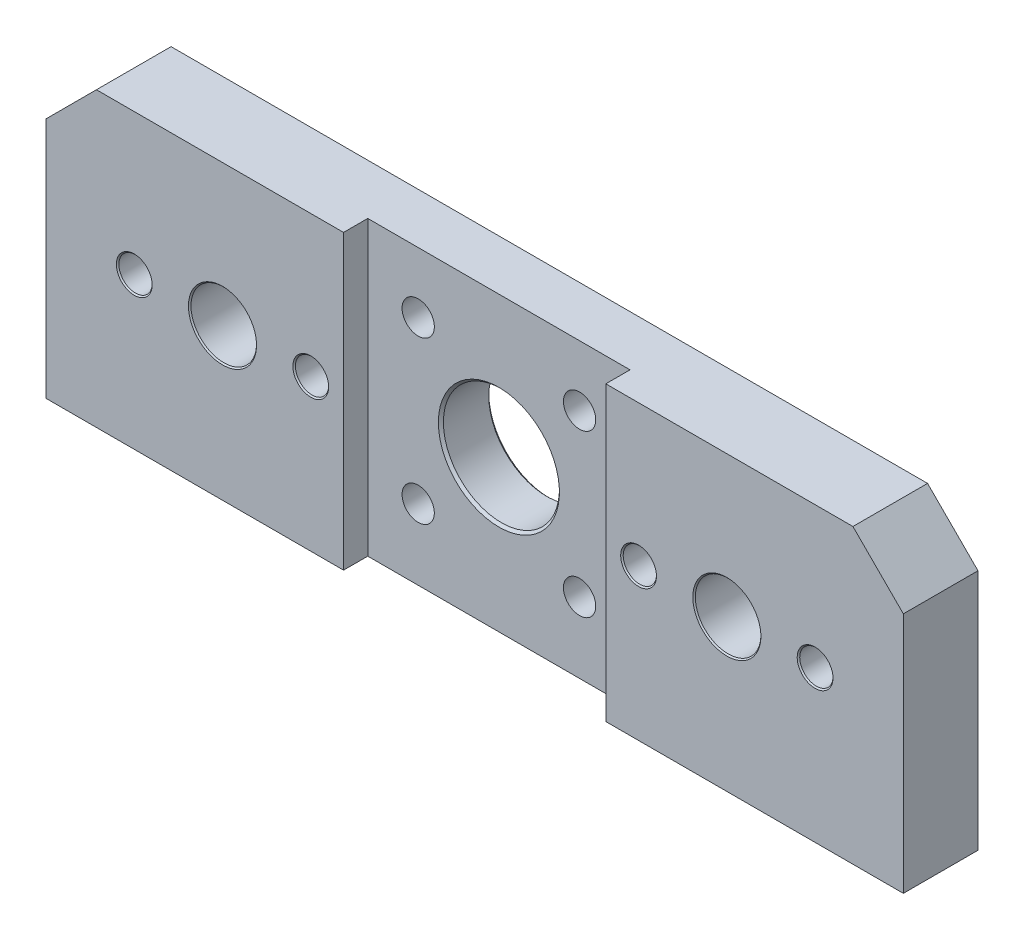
ISO-10303-21;
HEADER;
FILE_DESCRIPTION(('STEP AP214'),'2;1');
FILE_NAME('part.step','',(''),(''),'','','');
FILE_SCHEMA(('AUTOMOTIVE_DESIGN { 1 0 10303 214 1 1 1 1 }'));
ENDSEC;
DATA;
#1=APPLICATION_CONTEXT('core data for automotive mechanical design processes');
#2=APPLICATION_PROTOCOL_DEFINITION('international standard','automotive_design',2000,#1);
#3=PRODUCT_CONTEXT('',#1,'mechanical');
#4=PRODUCT('Part','Part','',(#3));
#5=PRODUCT_RELATED_PRODUCT_CATEGORY('part','',(#4));
#6=PRODUCT_DEFINITION_FORMATION('','',#4);
#7=PRODUCT_DEFINITION_CONTEXT('part definition',#1,'design');
#8=PRODUCT_DEFINITION('design','',#6,#7);
#9=PRODUCT_DEFINITION_SHAPE('','',#8);
#10=(LENGTH_UNIT() NAMED_UNIT(*) SI_UNIT(.MILLI.,.METRE.));
#11=(NAMED_UNIT(*) PLANE_ANGLE_UNIT() SI_UNIT($,.RADIAN.));
#12=(NAMED_UNIT(*) SI_UNIT($,.STERADIAN.) SOLID_ANGLE_UNIT());
#13=UNCERTAINTY_MEASURE_WITH_UNIT(LENGTH_MEASURE(1.E-05),#10,'distance_accuracy_value','');
#14=(GEOMETRIC_REPRESENTATION_CONTEXT(3) GLOBAL_UNCERTAINTY_ASSIGNED_CONTEXT((#13)) GLOBAL_UNIT_ASSIGNED_CONTEXT((#10,
#11,#12)) REPRESENTATION_CONTEXT('',''));
#15=CARTESIAN_POINT('',(0.,0.,0.));
#16=DIRECTION('',(0.,0.,1.));
#17=DIRECTION('',(1.,0.,0.));
#18=AXIS2_PLACEMENT_3D('',#15,#16,#17);
#19=CARTESIAN_POINT('',(-85.,58.,14.8));
#20=DIRECTION('',(0.,0.,-1.));
#21=DIRECTION('',(-1.,0.,0.));
#22=AXIS2_PLACEMENT_3D('',#19,#20,#21);
#23=PLANE('',#22);
#24=CARTESIAN_POINT('',(-67.5,30.,14.8));
#25=DIRECTION('',(0.,0.,-1.));
#26=DIRECTION('',(-1.,0.,0.));
#27=AXIS2_PLACEMENT_3D('',#24,#25,#26);
#28=CIRCLE('',#27,3.55);
#29=CARTESIAN_POINT('',(-71.05,30.,14.8));
#30=VERTEX_POINT('',#29);
#31=EDGE_CURVE('E297',#30,#30,#28,.T.);
#32=ORIENTED_EDGE('',*,*,#31,.T.);
#33=EDGE_LOOP('',(#32));
#34=FACE_BOUND('',#33,.T.);
#35=CARTESIAN_POINT('',(-50.,30.,14.8));
#36=DIRECTION('',(0.,0.,-1.));
#37=DIRECTION('',(-1.,0.,0.));
#38=AXIS2_PLACEMENT_3D('',#35,#36,#37);
#39=CIRCLE('',#38,6.75);
#40=CARTESIAN_POINT('',(-56.75,30.,14.8));
#41=VERTEX_POINT('',#40);
#42=EDGE_CURVE('E294',#41,#41,#39,.T.);
#43=ORIENTED_EDGE('',*,*,#42,.T.);
#44=EDGE_LOOP('',(#43));
#45=FACE_BOUND('',#44,.T.);
#46=CARTESIAN_POINT('',(-32.5,30.,14.8));
#47=DIRECTION('',(0.,0.,-1.));
#48=DIRECTION('',(-1.,0.,0.));
#49=AXIS2_PLACEMENT_3D('',#46,#47,#48);
#50=CIRCLE('',#49,3.55);
#51=CARTESIAN_POINT('',(-36.05,30.,14.8));
#52=VERTEX_POINT('',#51);
#53=EDGE_CURVE('E291',#52,#52,#50,.T.);
#54=ORIENTED_EDGE('',*,*,#53,.T.);
#55=EDGE_LOOP('',(#54));
#56=FACE_BOUND('',#55,.T.);
#57=DIRECTION('',(1.,0.,0.));
#58=VECTOR('',#57,1.);
#59=CARTESIAN_POINT('',(-85.,0.,14.8));
#60=LINE('',#59,#58);
#61=CARTESIAN_POINT('',(-85.,0.,14.8));
#62=VERTEX_POINT('',#61);
#63=CARTESIAN_POINT('',(-26.,0.,14.8));
#64=VERTEX_POINT('',#63);
#65=EDGE_CURVE('E198',#62,#64,#60,.T.);
#66=ORIENTED_EDGE('',*,*,#65,.T.);
#67=DIRECTION('',(0.,1.,0.));
#68=VECTOR('',#67,1.);
#69=CARTESIAN_POINT('',(-26.,58.,14.8));
#70=LINE('',#69,#68);
#71=CARTESIAN_POINT('',(-26.,58.,14.8));
#72=VERTEX_POINT('',#71);
#73=EDGE_CURVE('E231',#64,#72,#70,.T.);
#74=ORIENTED_EDGE('',*,*,#73,.T.);
#75=DIRECTION('',(-1.,0.,0.));
#76=VECTOR('',#75,1.);
#77=CARTESIAN_POINT('',(-85.,58.,14.8));
#78=LINE('',#77,#76);
#79=CARTESIAN_POINT('',(-75.,58.,14.8));
#80=VERTEX_POINT('',#79);
#81=EDGE_CURVE('E203',#72,#80,#78,.T.);
#82=ORIENTED_EDGE('',*,*,#81,.T.);
#83=DIRECTION('',(0.707106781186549,0.707106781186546,0.));
#84=VECTOR('',#83,1.);
#85=CARTESIAN_POINT('',(-85.,48.,14.8));
#86=LINE('',#85,#84);
#87=CARTESIAN_POINT('',(-85.,48.,14.8));
#88=VERTEX_POINT('',#87);
#89=EDGE_CURVE('E228',#80,#88,#86,.F.);
#90=ORIENTED_EDGE('',*,*,#89,.T.);
#91=DIRECTION('',(0.,-1.,0.));
#92=VECTOR('',#91,1.);
#93=CARTESIAN_POINT('',(-85.,0.,14.8));
#94=LINE('',#93,#92);
#95=EDGE_CURVE('E195',#88,#62,#94,.T.);
#96=ORIENTED_EDGE('',*,*,#95,.T.);
#97=EDGE_LOOP('',(#66,#74,#82,#90,#96));
#98=FACE_BOUND('',#97,.T.);
#99=ADVANCED_FACE('F33',(#34,#45,#56,#98),#23,.F.);
#100=CARTESIAN_POINT('',(-85.,0.,14.8));
#101=DIRECTION('',(1.,0.,0.));
#102=DIRECTION('',(0.,0.,-1.));
#103=AXIS2_PLACEMENT_3D('',#100,#101,#102);
#104=PLANE('',#103);
#105=ORIENTED_EDGE('',*,*,#95,.F.);
#106=DIRECTION('',(0.,0.,-1.));
#107=VECTOR('',#106,1.);
#108=CARTESIAN_POINT('',(-85.,48.,14.8));
#109=LINE('',#108,#107);
#110=CARTESIAN_POINT('',(-85.,48.,0.));
#111=VERTEX_POINT('',#110);
#112=EDGE_CURVE('E213',#88,#111,#109,.T.);
#113=ORIENTED_EDGE('',*,*,#112,.T.);
#114=DIRECTION('',(0.,-1.,0.));
#115=VECTOR('',#114,1.);
#116=CARTESIAN_POINT('',(-85.,0.,0.));
#117=LINE('',#116,#115);
#118=CARTESIAN_POINT('',(-85.,0.,0.));
#119=VERTEX_POINT('',#118);
#120=EDGE_CURVE('E186',#111,#119,#117,.T.);
#121=ORIENTED_EDGE('',*,*,#120,.T.);
#122=DIRECTION('',(0.,0.,-1.));
#123=VECTOR('',#122,1.);
#124=CARTESIAN_POINT('',(-85.,0.,14.8));
#125=LINE('',#124,#123);
#126=EDGE_CURVE('E210',#62,#119,#125,.T.);
#127=ORIENTED_EDGE('',*,*,#126,.F.);
#128=EDGE_LOOP('',(#105,#113,#121,#127));
#129=FACE_BOUND('',#128,.T.);
#130=ADVANCED_FACE('F35',(#129),#104,.F.);
#131=CARTESIAN_POINT('',(-85.,0.,14.8));
#132=DIRECTION('',(0.,1.,0.));
#133=DIRECTION('',(0.,0.,1.));
#134=AXIS2_PLACEMENT_3D('',#131,#132,#133);
#135=PLANE('',#134);
#136=CARTESIAN_POINT('',(73.,0.,7.5));
#137=DIRECTION('',(0.,-1.,0.));
#138=DIRECTION('',(0.,0.,-1.));
#139=AXIS2_PLACEMENT_3D('',#136,#137,#138);
#140=CIRCLE('',#139,2.4);
#141=CARTESIAN_POINT('',(73.,0.,5.1));
#142=VERTEX_POINT('',#141);
#143=EDGE_CURVE('E126',#142,#142,#140,.T.);
#144=ORIENTED_EDGE('',*,*,#143,.F.);
#145=EDGE_LOOP('',(#144));
#146=FACE_BOUND('',#145,.T.);
#147=CARTESIAN_POINT('',(-73.,0.,7.49999999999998));
#148=DIRECTION('',(0.,-1.,0.));
#149=DIRECTION('',(0.,0.,-1.));
#150=AXIS2_PLACEMENT_3D('',#147,#148,#149);
#151=CIRCLE('',#150,2.4);
#152=CARTESIAN_POINT('',(-73.,0.,5.09999999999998));
#153=VERTEX_POINT('',#152);
#154=EDGE_CURVE('E139',#153,#153,#151,.T.);
#155=ORIENTED_EDGE('',*,*,#154,.F.);
#156=EDGE_LOOP('',(#155));
#157=FACE_BOUND('',#156,.T.);
#158=DIRECTION('',(1.,0.,0.));
#159=VECTOR('',#158,1.);
#160=CARTESIAN_POINT('',(-26.,0.,10.));
#161=LINE('',#160,#159);
#162=CARTESIAN_POINT('',(-26.,0.,10.));
#163=VERTEX_POINT('',#162);
#164=CARTESIAN_POINT('',(26.,0.,10.));
#165=VERTEX_POINT('',#164);
#166=EDGE_CURVE('E170',#163,#165,#161,.T.);
#167=ORIENTED_EDGE('',*,*,#166,.F.);
#168=DIRECTION('',(0.,0.,1.));
#169=VECTOR('',#168,1.);
#170=CARTESIAN_POINT('',(-26.,0.,10.));
#171=LINE('',#170,#169);
#172=EDGE_CURVE('E176',#163,#64,#171,.T.);
#173=ORIENTED_EDGE('',*,*,#172,.T.);
#174=ORIENTED_EDGE('',*,*,#65,.F.);
#175=ORIENTED_EDGE('',*,*,#126,.T.);
#176=DIRECTION('',(1.,0.,0.));
#177=VECTOR('',#176,1.);
#178=CARTESIAN_POINT('',(-85.,0.,0.));
#179=LINE('',#178,#177);
#180=CARTESIAN_POINT('',(85.,0.,0.));
#181=VERTEX_POINT('',#180);
#182=EDGE_CURVE('E188',#119,#181,#179,.T.);
#183=ORIENTED_EDGE('',*,*,#182,.T.);
#184=DIRECTION('',(0.,0.,-1.));
#185=VECTOR('',#184,1.);
#186=CARTESIAN_POINT('',(85.,0.,14.8));
#187=LINE('',#186,#185);
#188=CARTESIAN_POINT('',(85.,0.,14.8));
#189=VERTEX_POINT('',#188);
#190=EDGE_CURVE('E207',#189,#181,#187,.T.);
#191=ORIENTED_EDGE('',*,*,#190,.F.);
#192=CARTESIAN_POINT('',(26.,0.,14.8));
#193=VERTEX_POINT('',#192);
#194=EDGE_CURVE('E197',#193,#189,#60,.T.);
#195=ORIENTED_EDGE('',*,*,#194,.F.);
#196=DIRECTION('',(0.,0.,1.));
#197=VECTOR('',#196,1.);
#198=CARTESIAN_POINT('',(26.,0.,10.));
#199=LINE('',#198,#197);
#200=EDGE_CURVE('E48',#165,#193,#199,.T.);
#201=ORIENTED_EDGE('',*,*,#200,.F.);
#202=EDGE_LOOP('',(#167,#173,#174,#175,#183,#191,#195,#201));
#203=FACE_BOUND('',#202,.T.);
#204=ADVANCED_FACE('F355',(#146,#157,#203),#135,.F.);
#205=CARTESIAN_POINT('',(85.,0.,14.8));
#206=DIRECTION('',(-1.,0.,0.));
#207=DIRECTION('',(0.,-1.,0.));
#208=AXIS2_PLACEMENT_3D('',#205,#206,#207);
#209=PLANE('',#208);
#210=DIRECTION('',(0.,1.,0.));
#211=VECTOR('',#210,1.);
#212=CARTESIAN_POINT('',(85.,0.,0.));
#213=LINE('',#212,#211);
#214=CARTESIAN_POINT('',(85.,47.9999999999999,0.));
#215=VERTEX_POINT('',#214);
#216=EDGE_CURVE('E190',#181,#215,#213,.T.);
#217=ORIENTED_EDGE('',*,*,#216,.T.);
#218=DIRECTION('',(0.,0.,1.));
#219=VECTOR('',#218,1.);
#220=CARTESIAN_POINT('',(85.,48.,14.8));
#221=LINE('',#220,#219);
#222=CARTESIAN_POINT('',(85.,48.,14.8));
#223=VERTEX_POINT('',#222);
#224=EDGE_CURVE('E56',#215,#223,#221,.T.);
#225=ORIENTED_EDGE('',*,*,#224,.T.);
#226=DIRECTION('',(0.,1.,0.));
#227=VECTOR('',#226,1.);
#228=CARTESIAN_POINT('',(85.,0.,14.8));
#229=LINE('',#228,#227);
#230=EDGE_CURVE('E201',#189,#223,#229,.T.);
#231=ORIENTED_EDGE('',*,*,#230,.F.);
#232=ORIENTED_EDGE('',*,*,#190,.T.);
#233=EDGE_LOOP('',(#217,#225,#231,#232));
#234=FACE_BOUND('',#233,.T.);
#235=ADVANCED_FACE('F351',(#234),#209,.F.);
#236=CARTESIAN_POINT('',(-85.,58.,14.8));
#237=DIRECTION('',(0.,-1.,0.));
#238=DIRECTION('',(0.,0.,-1.));
#239=AXIS2_PLACEMENT_3D('',#236,#237,#238);
#240=PLANE('',#239);
#241=ORIENTED_EDGE('',*,*,#81,.F.);
#242=DIRECTION('',(0.,0.,-1.));
#243=VECTOR('',#242,1.);
#244=CARTESIAN_POINT('',(-26.,58.,14.8));
#245=LINE('',#244,#243);
#246=CARTESIAN_POINT('',(-26.,58.,10.));
#247=VERTEX_POINT('',#246);
#248=EDGE_CURVE('E183',#72,#247,#245,.T.);
#249=ORIENTED_EDGE('',*,*,#248,.T.);
#250=DIRECTION('',(1.,0.,0.));
#251=VECTOR('',#250,1.);
#252=CARTESIAN_POINT('',(-85.,58.,10.));
#253=LINE('',#252,#251);
#254=CARTESIAN_POINT('',(26.,58.,10.));
#255=VERTEX_POINT('',#254);
#256=EDGE_CURVE('E234',#247,#255,#253,.T.);
#257=ORIENTED_EDGE('',*,*,#256,.T.);
#258=DIRECTION('',(0.,0.,1.));
#259=VECTOR('',#258,1.);
#260=CARTESIAN_POINT('',(26.,58.,14.8));
#261=LINE('',#260,#259);
#262=CARTESIAN_POINT('',(26.,58.,14.8));
#263=VERTEX_POINT('',#262);
#264=EDGE_CURVE('E178',#255,#263,#261,.T.);
#265=ORIENTED_EDGE('',*,*,#264,.T.);
#266=CARTESIAN_POINT('',(75.0000000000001,58.,14.8));
#267=VERTEX_POINT('',#266);
#268=EDGE_CURVE('E204',#267,#263,#78,.T.);
#269=ORIENTED_EDGE('',*,*,#268,.F.);
#270=DIRECTION('',(0.,0.,-1.));
#271=VECTOR('',#270,1.);
#272=CARTESIAN_POINT('',(75.0000000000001,58.,14.8));
#273=LINE('',#272,#271);
#274=CARTESIAN_POINT('',(75.0000000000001,58.,0.));
#275=VERTEX_POINT('',#274);
#276=EDGE_CURVE('E220',#267,#275,#273,.T.);
#277=ORIENTED_EDGE('',*,*,#276,.T.);
#278=DIRECTION('',(-1.,0.,0.));
#279=VECTOR('',#278,1.);
#280=CARTESIAN_POINT('',(-85.,58.,0.));
#281=LINE('',#280,#279);
#282=CARTESIAN_POINT('',(-75.,58.,0.));
#283=VERTEX_POINT('',#282);
#284=EDGE_CURVE('E192',#275,#283,#281,.T.);
#285=ORIENTED_EDGE('',*,*,#284,.T.);
#286=DIRECTION('',(0.,0.,1.));
#287=VECTOR('',#286,1.);
#288=CARTESIAN_POINT('',(-75.,58.,14.8));
#289=LINE('',#288,#287);
#290=EDGE_CURVE('E223',#283,#80,#289,.T.);
#291=ORIENTED_EDGE('',*,*,#290,.T.);
#292=EDGE_LOOP('',(#241,#249,#257,#265,#269,#277,#285,#291));
#293=FACE_BOUND('',#292,.T.);
#294=ADVANCED_FACE('F332',(#293),#240,.F.);
#295=CARTESIAN_POINT('',(32.5,30.,14.8));
#296=DIRECTION('',(0.,0.,-1.));
#297=DIRECTION('',(-1.,0.,0.));
#298=AXIS2_PLACEMENT_3D('',#295,#296,#297);
#299=CIRCLE('',#298,3.55);
#300=CARTESIAN_POINT('',(28.95,30.,14.8));
#301=VERTEX_POINT('',#300);
#302=EDGE_CURVE('E312',#301,#301,#299,.T.);
#303=ORIENTED_EDGE('',*,*,#302,.T.);
#304=EDGE_LOOP('',(#303));
#305=FACE_BOUND('',#304,.T.);
#306=CARTESIAN_POINT('',(50.,30.,14.8));
#307=DIRECTION('',(0.,0.,-1.));
#308=DIRECTION('',(-1.,0.,0.));
#309=AXIS2_PLACEMENT_3D('',#306,#307,#308);
#310=CIRCLE('',#309,6.75);
#311=CARTESIAN_POINT('',(43.25,30.,14.8));
#312=VERTEX_POINT('',#311);
#313=EDGE_CURVE('E309',#312,#312,#310,.T.);
#314=ORIENTED_EDGE('',*,*,#313,.T.);
#315=EDGE_LOOP('',(#314));
#316=FACE_BOUND('',#315,.T.);
#317=CARTESIAN_POINT('',(67.5,30.,14.8));
#318=DIRECTION('',(0.,0.,-1.));
#319=DIRECTION('',(-1.,0.,0.));
#320=AXIS2_PLACEMENT_3D('',#317,#318,#319);
#321=CIRCLE('',#320,3.55);
#322=CARTESIAN_POINT('',(63.95,30.,14.8));
#323=VERTEX_POINT('',#322);
#324=EDGE_CURVE('E306',#323,#323,#321,.T.);
#325=ORIENTED_EDGE('',*,*,#324,.T.);
#326=EDGE_LOOP('',(#325));
#327=FACE_BOUND('',#326,.T.);
#328=ORIENTED_EDGE('',*,*,#268,.T.);
#329=DIRECTION('',(0.,1.,0.));
#330=VECTOR('',#329,1.);
#331=CARTESIAN_POINT('',(26.,0.,14.8));
#332=LINE('',#331,#330);
#333=EDGE_CURVE('E166',#193,#263,#332,.T.);
#334=ORIENTED_EDGE('',*,*,#333,.F.);
#335=ORIENTED_EDGE('',*,*,#194,.T.);
#336=ORIENTED_EDGE('',*,*,#230,.T.);
#337=DIRECTION('',(0.707106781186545,-0.70710678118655,0.));
#338=VECTOR('',#337,1.);
#339=CARTESIAN_POINT('',(75.0000000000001,58.,14.8));
#340=LINE('',#339,#338);
#341=EDGE_CURVE('E226',#223,#267,#340,.F.);
#342=ORIENTED_EDGE('',*,*,#341,.T.);
#343=EDGE_LOOP('',(#328,#334,#335,#336,#342));
#344=FACE_BOUND('',#343,.T.);
#345=ADVANCED_FACE('F328',(#305,#316,#327,#344),#23,.F.);
#346=CARTESIAN_POINT('',(-85.,58.,0.));
#347=DIRECTION('',(0.,0.,-1.));
#348=DIRECTION('',(-1.,0.,0.));
#349=AXIS2_PLACEMENT_3D('',#346,#347,#348);
#350=PLANE('',#349);
#351=CARTESIAN_POINT('',(16.,46.,0.));
#352=DIRECTION('',(0.,0.,1.));
#353=DIRECTION('',(1.,0.,0.));
#354=AXIS2_PLACEMENT_3D('',#351,#352,#353);
#355=CIRCLE('',#354,3.2);
#356=CARTESIAN_POINT('',(19.2,46.,0.));
#357=VERTEX_POINT('',#356);
#358=EDGE_CURVE('E619',#357,#357,#355,.T.);
#359=ORIENTED_EDGE('',*,*,#358,.T.);
#360=EDGE_LOOP('',(#359));
#361=FACE_BOUND('',#360,.T.);
#362=CARTESIAN_POINT('',(16.,14.,0.));
#363=DIRECTION('',(0.,0.,1.));
#364=DIRECTION('',(1.,0.,0.));
#365=AXIS2_PLACEMENT_3D('',#362,#363,#364);
#366=CIRCLE('',#365,3.2);
#367=CARTESIAN_POINT('',(19.2,14.,0.));
#368=VERTEX_POINT('',#367);
#369=EDGE_CURVE('E620',#368,#368,#366,.T.);
#370=ORIENTED_EDGE('',*,*,#369,.T.);
#371=EDGE_LOOP('',(#370));
#372=FACE_BOUND('',#371,.T.);
#373=CARTESIAN_POINT('',(-16.,46.,0.));
#374=DIRECTION('',(0.,0.,1.));
#375=DIRECTION('',(1.,0.,0.));
#376=AXIS2_PLACEMENT_3D('',#373,#374,#375);
#377=CIRCLE('',#376,3.2);
#378=CARTESIAN_POINT('',(-12.8,46.,0.));
#379=VERTEX_POINT('',#378);
#380=EDGE_CURVE('E627',#379,#379,#377,.T.);
#381=ORIENTED_EDGE('',*,*,#380,.T.);
#382=EDGE_LOOP('',(#381));
#383=FACE_BOUND('',#382,.T.);
#384=CARTESIAN_POINT('',(-16.,14.,0.));
#385=DIRECTION('',(0.,0.,1.));
#386=DIRECTION('',(1.,0.,0.));
#387=AXIS2_PLACEMENT_3D('',#384,#385,#386);
#388=CIRCLE('',#387,3.2);
#389=CARTESIAN_POINT('',(-12.8,14.,0.));
#390=VERTEX_POINT('',#389);
#391=EDGE_CURVE('E133',#390,#390,#388,.T.);
#392=ORIENTED_EDGE('',*,*,#391,.T.);
#393=EDGE_LOOP('',(#392));
#394=FACE_BOUND('',#393,.T.);
#395=CARTESIAN_POINT('',(67.5,30.,0.));
#396=DIRECTION('',(0.,0.,-1.));
#397=DIRECTION('',(-1.,0.,0.));
#398=AXIS2_PLACEMENT_3D('',#395,#396,#397);
#399=CIRCLE('',#398,6.25000000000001);
#400=CARTESIAN_POINT('',(61.25,30.,0.));
#401=VERTEX_POINT('',#400);
#402=EDGE_CURVE('E267',#401,#401,#399,.F.);
#403=ORIENTED_EDGE('',*,*,#402,.T.);
#404=EDGE_LOOP('',(#403));
#405=FACE_BOUND('',#404,.T.);
#406=CARTESIAN_POINT('',(50.,30.,0.));
#407=DIRECTION('',(0.,0.,-1.));
#408=DIRECTION('',(-1.,0.,0.));
#409=AXIS2_PLACEMENT_3D('',#406,#407,#408);
#410=CIRCLE('',#409,6.75);
#411=CARTESIAN_POINT('',(43.25,30.,0.));
#412=VERTEX_POINT('',#411);
#413=EDGE_CURVE('E264',#412,#412,#410,.F.);
#414=ORIENTED_EDGE('',*,*,#413,.T.);
#415=EDGE_LOOP('',(#414));
#416=FACE_BOUND('',#415,.T.);
#417=CARTESIAN_POINT('',(32.5,30.,0.));
#418=DIRECTION('',(0.,0.,-1.));
#419=DIRECTION('',(-1.,0.,0.));
#420=AXIS2_PLACEMENT_3D('',#417,#418,#419);
#421=CIRCLE('',#420,6.25);
#422=CARTESIAN_POINT('',(26.25,30.,0.));
#423=VERTEX_POINT('',#422);
#424=EDGE_CURVE('E261',#423,#423,#421,.F.);
#425=ORIENTED_EDGE('',*,*,#424,.T.);
#426=EDGE_LOOP('',(#425));
#427=FACE_BOUND('',#426,.T.);
#428=CARTESIAN_POINT('',(-32.5,30.,0.));
#429=DIRECTION('',(0.,0.,-1.));
#430=DIRECTION('',(-1.,0.,0.));
#431=AXIS2_PLACEMENT_3D('',#428,#429,#430);
#432=CIRCLE('',#431,6.25);
#433=CARTESIAN_POINT('',(-38.75,30.,0.));
#434=VERTEX_POINT('',#433);
#435=EDGE_CURVE('E258',#434,#434,#432,.F.);
#436=ORIENTED_EDGE('',*,*,#435,.T.);
#437=EDGE_LOOP('',(#436));
#438=FACE_BOUND('',#437,.T.);
#439=CARTESIAN_POINT('',(-50.,30.,0.));
#440=DIRECTION('',(0.,0.,-1.));
#441=DIRECTION('',(-1.,0.,0.));
#442=AXIS2_PLACEMENT_3D('',#439,#440,#441);
#443=CIRCLE('',#442,6.75);
#444=CARTESIAN_POINT('',(-56.75,30.,0.));
#445=VERTEX_POINT('',#444);
#446=EDGE_CURVE('E255',#445,#445,#443,.F.);
#447=ORIENTED_EDGE('',*,*,#446,.T.);
#448=EDGE_LOOP('',(#447));
#449=FACE_BOUND('',#448,.T.);
#450=CARTESIAN_POINT('',(-67.5,30.,0.));
#451=DIRECTION('',(0.,0.,-1.));
#452=DIRECTION('',(-1.,0.,0.));
#453=AXIS2_PLACEMENT_3D('',#450,#451,#452);
#454=CIRCLE('',#453,6.25000000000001);
#455=CARTESIAN_POINT('',(-73.75,30.,0.));
#456=VERTEX_POINT('',#455);
#457=EDGE_CURVE('E252',#456,#456,#454,.F.);
#458=ORIENTED_EDGE('',*,*,#457,.T.);
#459=EDGE_LOOP('',(#458));
#460=FACE_BOUND('',#459,.T.);
#461=CARTESIAN_POINT('',(0.,30.,0.));
#462=DIRECTION('',(0.,0.,-1.));
#463=DIRECTION('',(-1.,0.,0.));
#464=AXIS2_PLACEMENT_3D('',#461,#462,#463);
#465=CIRCLE('',#464,12.);
#466=CARTESIAN_POINT('',(-12.,30.,0.));
#467=VERTEX_POINT('',#466);
#468=EDGE_CURVE('E237',#467,#467,#465,.F.);
#469=ORIENTED_EDGE('',*,*,#468,.T.);
#470=EDGE_LOOP('',(#469));
#471=FACE_BOUND('',#470,.T.);
#472=ORIENTED_EDGE('',*,*,#120,.F.);
#473=DIRECTION('',(-0.707106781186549,-0.707106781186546,0.));
#474=VECTOR('',#473,1.);
#475=CARTESIAN_POINT('',(-80.,53.,0.));
#476=LINE('',#475,#474);
#477=EDGE_CURVE('E218',#111,#283,#476,.F.);
#478=ORIENTED_EDGE('',*,*,#477,.T.);
#479=ORIENTED_EDGE('',*,*,#284,.F.);
#480=DIRECTION('',(-0.707106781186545,0.70710678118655,0.));
#481=VECTOR('',#480,1.);
#482=CARTESIAN_POINT('',(-4.99999999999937,138.,0.));
#483=LINE('',#482,#481);
#484=EDGE_CURVE('E216',#275,#215,#483,.F.);
#485=ORIENTED_EDGE('',*,*,#484,.T.);
#486=ORIENTED_EDGE('',*,*,#216,.F.);
#487=ORIENTED_EDGE('',*,*,#182,.F.);
#488=EDGE_LOOP('',(#472,#478,#479,#485,#486,#487));
#489=FACE_BOUND('',#488,.T.);
#490=ADVANCED_FACE('F331',(#361,#372,#383,#394,#405,#416,#427,#438,#449,#460,#471,#489),#350,.T.);
#491=CARTESIAN_POINT('',(-85.,48.,14.8));
#492=DIRECTION('',(0.707106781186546,-0.707106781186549,0.));
#493=DIRECTION('',(0.707106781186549,0.707106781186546,0.));
#494=AXIS2_PLACEMENT_3D('',#491,#492,#493);
#495=PLANE('',#494);
#496=ORIENTED_EDGE('',*,*,#89,.F.);
#497=ORIENTED_EDGE('',*,*,#290,.F.);
#498=ORIENTED_EDGE('',*,*,#477,.F.);
#499=ORIENTED_EDGE('',*,*,#112,.F.);
#500=EDGE_LOOP('',(#496,#497,#498,#499));
#501=FACE_BOUND('',#500,.T.);
#502=ADVANCED_FACE('F363',(#501),#495,.F.);
#503=CARTESIAN_POINT('',(75.0000000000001,58.,14.8));
#504=DIRECTION('',(-0.70710678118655,-0.707106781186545,0.));
#505=DIRECTION('',(0.707106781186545,-0.70710678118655,0.));
#506=AXIS2_PLACEMENT_3D('',#503,#504,#505);
#507=PLANE('',#506);
#508=ORIENTED_EDGE('',*,*,#341,.F.);
#509=ORIENTED_EDGE('',*,*,#224,.F.);
#510=ORIENTED_EDGE('',*,*,#484,.F.);
#511=ORIENTED_EDGE('',*,*,#276,.F.);
#512=EDGE_LOOP('',(#508,#509,#510,#511));
#513=FACE_BOUND('',#512,.T.);
#514=ADVANCED_FACE('F346',(#513),#507,.F.);
#515=CARTESIAN_POINT('',(-26.,0.,10.));
#516=DIRECTION('',(0.,0.,-1.));
#517=DIRECTION('',(-1.,0.,0.));
#518=AXIS2_PLACEMENT_3D('',#515,#516,#517);
#519=PLANE('',#518);
#520=CARTESIAN_POINT('',(16.,46.,10.));
#521=DIRECTION('',(0.,0.,1.));
#522=DIRECTION('',(1.,0.,0.));
#523=AXIS2_PLACEMENT_3D('',#520,#521,#522);
#524=CIRCLE('',#523,3.2);
#525=CARTESIAN_POINT('',(19.2,46.,10.));
#526=VERTEX_POINT('',#525);
#527=EDGE_CURVE('E529',#526,#526,#524,.T.);
#528=ORIENTED_EDGE('',*,*,#527,.F.);
#529=EDGE_LOOP('',(#528));
#530=FACE_BOUND('',#529,.T.);
#531=CARTESIAN_POINT('',(16.,14.,10.));
#532=DIRECTION('',(0.,0.,1.));
#533=DIRECTION('',(1.,0.,0.));
#534=AXIS2_PLACEMENT_3D('',#531,#532,#533);
#535=CIRCLE('',#534,3.2);
#536=CARTESIAN_POINT('',(19.2,14.,10.));
#537=VERTEX_POINT('',#536);
#538=EDGE_CURVE('E533',#537,#537,#535,.T.);
#539=ORIENTED_EDGE('',*,*,#538,.F.);
#540=EDGE_LOOP('',(#539));
#541=FACE_BOUND('',#540,.T.);
#542=CARTESIAN_POINT('',(-16.,46.,10.));
#543=DIRECTION('',(0.,0.,1.));
#544=DIRECTION('',(1.,0.,0.));
#545=AXIS2_PLACEMENT_3D('',#542,#543,#544);
#546=CIRCLE('',#545,3.2);
#547=CARTESIAN_POINT('',(-12.8,46.,10.));
#548=VERTEX_POINT('',#547);
#549=EDGE_CURVE('E537',#548,#548,#546,.T.);
#550=ORIENTED_EDGE('',*,*,#549,.F.);
#551=EDGE_LOOP('',(#550));
#552=FACE_BOUND('',#551,.T.);
#553=CARTESIAN_POINT('',(-16.,14.,10.));
#554=DIRECTION('',(0.,0.,1.));
#555=DIRECTION('',(1.,0.,0.));
#556=AXIS2_PLACEMENT_3D('',#553,#554,#555);
#557=CIRCLE('',#556,3.2);
#558=CARTESIAN_POINT('',(-12.8,14.,10.));
#559=VERTEX_POINT('',#558);
#560=EDGE_CURVE('E127',#559,#559,#557,.T.);
#561=ORIENTED_EDGE('',*,*,#560,.F.);
#562=EDGE_LOOP('',(#561));
#563=FACE_BOUND('',#562,.T.);
#564=CARTESIAN_POINT('',(0.,30.,10.));
#565=DIRECTION('',(0.,0.,-1.));
#566=DIRECTION('',(-1.,0.,0.));
#567=AXIS2_PLACEMENT_3D('',#564,#565,#566);
#568=CIRCLE('',#567,12.);
#569=CARTESIAN_POINT('',(-12.,30.,10.));
#570=VERTEX_POINT('',#569);
#571=EDGE_CURVE('E246',#570,#570,#568,.T.);
#572=ORIENTED_EDGE('',*,*,#571,.T.);
#573=EDGE_LOOP('',(#572));
#574=FACE_BOUND('',#573,.T.);
#575=DIRECTION('',(0.,-1.,0.));
#576=VECTOR('',#575,1.);
#577=CARTESIAN_POINT('',(-26.,0.,10.));
#578=LINE('',#577,#576);
#579=EDGE_CURVE('E168',#247,#163,#578,.T.);
#580=ORIENTED_EDGE('',*,*,#579,.T.);
#581=ORIENTED_EDGE('',*,*,#166,.T.);
#582=DIRECTION('',(0.,1.,0.));
#583=VECTOR('',#582,1.);
#584=CARTESIAN_POINT('',(26.,0.,10.));
#585=LINE('',#584,#583);
#586=EDGE_CURVE('E173',#165,#255,#585,.T.);
#587=ORIENTED_EDGE('',*,*,#586,.T.);
#588=ORIENTED_EDGE('',*,*,#256,.F.);
#589=EDGE_LOOP('',(#580,#581,#587,#588));
#590=FACE_BOUND('',#589,.T.);
#591=ADVANCED_FACE('F371',(#530,#541,#552,#563,#574,#590),#519,.F.);
#592=CARTESIAN_POINT('',(-26.,0.,10.));
#593=DIRECTION('',(-1.,0.,0.));
#594=DIRECTION('',(0.,-1.,0.));
#595=AXIS2_PLACEMENT_3D('',#592,#593,#594);
#596=PLANE('',#595);
#597=ORIENTED_EDGE('',*,*,#73,.F.);
#598=ORIENTED_EDGE('',*,*,#172,.F.);
#599=ORIENTED_EDGE('',*,*,#579,.F.);
#600=ORIENTED_EDGE('',*,*,#248,.F.);
#601=EDGE_LOOP('',(#597,#598,#599,#600));
#602=FACE_BOUND('',#601,.T.);
#603=ADVANCED_FACE('F368',(#602),#596,.F.);
#604=CARTESIAN_POINT('',(26.,0.,10.));
#605=DIRECTION('',(1.,0.,0.));
#606=DIRECTION('',(0.,1.,0.));
#607=AXIS2_PLACEMENT_3D('',#604,#605,#606);
#608=PLANE('',#607);
#609=ORIENTED_EDGE('',*,*,#586,.F.);
#610=ORIENTED_EDGE('',*,*,#200,.T.);
#611=ORIENTED_EDGE('',*,*,#333,.T.);
#612=ORIENTED_EDGE('',*,*,#264,.F.);
#613=EDGE_LOOP('',(#609,#610,#611,#612));
#614=FACE_BOUND('',#613,.T.);
#615=ADVANCED_FACE('F372',(#614),#608,.F.);
#616=CARTESIAN_POINT('',(0.,30.,0.));
#617=DIRECTION('',(0.,0.,1.));
#618=DIRECTION('',(1.,0.,0.));
#619=AXIS2_PLACEMENT_3D('',#616,#617,#618);
#620=CYLINDRICAL_SURFACE('',#619,11.5);
#621=CARTESIAN_POINT('',(0.,30.,0.500000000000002));
#622=DIRECTION('',(0.,0.,-1.));
#623=DIRECTION('',(-1.,0.,0.));
#624=AXIS2_PLACEMENT_3D('',#621,#622,#623);
#625=CIRCLE('',#624,11.5);
#626=CARTESIAN_POINT('',(-11.5,30.,0.500000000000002));
#627=VERTEX_POINT('',#626);
#628=EDGE_CURVE('E243',#627,#627,#625,.T.);
#629=ORIENTED_EDGE('',*,*,#628,.T.);
#630=EDGE_LOOP('',(#629));
#631=FACE_BOUND('',#630,.T.);
#632=CARTESIAN_POINT('',(0.,30.,9.5));
#633=DIRECTION('',(0.,0.,-1.));
#634=DIRECTION('',(-1.,0.,0.));
#635=AXIS2_PLACEMENT_3D('',#632,#633,#634);
#636=CIRCLE('',#635,11.5);
#637=CARTESIAN_POINT('',(-11.5,30.,9.5));
#638=VERTEX_POINT('',#637);
#639=EDGE_CURVE('E240',#638,#638,#636,.F.);
#640=ORIENTED_EDGE('',*,*,#639,.T.);
#641=EDGE_LOOP('',(#640));
#642=FACE_BOUND('',#641,.T.);
#643=ADVANCED_FACE('F374',(#631,#642),#620,.F.);
#644=CARTESIAN_POINT('',(-50.,30.,0.));
#645=DIRECTION('',(0.,0.,1.));
#646=DIRECTION('',(1.,0.,0.));
#647=AXIS2_PLACEMENT_3D('',#644,#645,#646);
#648=CYLINDRICAL_SURFACE('',#647,6.5);
#649=CARTESIAN_POINT('',(-50.,30.,0.249999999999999));
#650=DIRECTION('',(0.,0.,-1.));
#651=DIRECTION('',(-1.,0.,0.));
#652=AXIS2_PLACEMENT_3D('',#649,#650,#651);
#653=CIRCLE('',#652,6.5);
#654=CARTESIAN_POINT('',(-56.5,30.,0.249999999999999));
#655=VERTEX_POINT('',#654);
#656=EDGE_CURVE('E285',#655,#655,#653,.T.);
#657=ORIENTED_EDGE('',*,*,#656,.T.);
#658=EDGE_LOOP('',(#657));
#659=FACE_BOUND('',#658,.T.);
#660=CARTESIAN_POINT('',(-50.,30.,14.55));
#661=DIRECTION('',(0.,0.,-1.));
#662=DIRECTION('',(-1.,0.,0.));
#663=AXIS2_PLACEMENT_3D('',#660,#661,#662);
#664=CIRCLE('',#663,6.5);
#665=CARTESIAN_POINT('',(-56.5,30.,14.55));
#666=VERTEX_POINT('',#665);
#667=EDGE_CURVE('E282',#666,#666,#664,.F.);
#668=ORIENTED_EDGE('',*,*,#667,.T.);
#669=EDGE_LOOP('',(#668));
#670=FACE_BOUND('',#669,.T.);
#671=ADVANCED_FACE('F380',(#659,#670),#648,.F.);
#672=CARTESIAN_POINT('',(50.,30.,0.));
#673=DIRECTION('',(0.,0.,1.));
#674=DIRECTION('',(1.,0.,0.));
#675=AXIS2_PLACEMENT_3D('',#672,#673,#674);
#676=CYLINDRICAL_SURFACE('',#675,6.5);
#677=CARTESIAN_POINT('',(50.,30.,0.249999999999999));
#678=DIRECTION('',(0.,0.,-1.));
#679=DIRECTION('',(-1.,0.,0.));
#680=AXIS2_PLACEMENT_3D('',#677,#678,#679);
#681=CIRCLE('',#680,6.5);
#682=CARTESIAN_POINT('',(43.5,30.,0.249999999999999));
#683=VERTEX_POINT('',#682);
#684=EDGE_CURVE('E273',#683,#683,#681,.T.);
#685=ORIENTED_EDGE('',*,*,#684,.T.);
#686=EDGE_LOOP('',(#685));
#687=FACE_BOUND('',#686,.T.);
#688=CARTESIAN_POINT('',(50.,30.,14.55));
#689=DIRECTION('',(0.,0.,-1.));
#690=DIRECTION('',(-1.,0.,0.));
#691=AXIS2_PLACEMENT_3D('',#688,#689,#690);
#692=CIRCLE('',#691,6.5);
#693=CARTESIAN_POINT('',(43.5,30.,14.55));
#694=VERTEX_POINT('',#693);
#695=EDGE_CURVE('E270',#694,#694,#692,.F.);
#696=ORIENTED_EDGE('',*,*,#695,.T.);
#697=EDGE_LOOP('',(#696));
#698=FACE_BOUND('',#697,.T.);
#699=ADVANCED_FACE('F513',(#687,#698),#676,.F.);
#700=CARTESIAN_POINT('',(-67.5,30.,0.));
#701=DIRECTION('',(0.,0.,-1.));
#702=DIRECTION('',(-1.,0.,0.));
#703=AXIS2_PLACEMENT_3D('',#700,#701,#702);
#704=CYLINDRICAL_SURFACE('',#703,6.);
#705=CARTESIAN_POINT('',(-67.5,30.,0.249999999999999));
#706=DIRECTION('',(0.,0.,-1.));
#707=DIRECTION('',(-1.,0.,0.));
#708=AXIS2_PLACEMENT_3D('',#705,#706,#707);
#709=CIRCLE('',#708,6.);
#710=CARTESIAN_POINT('',(-73.5,30.,0.249999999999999));
#711=VERTEX_POINT('',#710);
#712=EDGE_CURVE('E288',#711,#711,#709,.T.);
#713=ORIENTED_EDGE('',*,*,#712,.T.);
#714=EDGE_LOOP('',(#713));
#715=FACE_BOUND('',#714,.T.);
#716=CARTESIAN_POINT('',(-67.5,30.,7.));
#717=DIRECTION('',(0.,0.,-1.));
#718=DIRECTION('',(-1.,0.,0.));
#719=AXIS2_PLACEMENT_3D('',#716,#717,#718);
#720=CIRCLE('',#719,6.);
#721=CARTESIAN_POINT('',(-73.5,30.,7.));
#722=VERTEX_POINT('',#721);
#723=EDGE_CURVE('E163',#722,#722,#720,.T.);
#724=ORIENTED_EDGE('',*,*,#723,.F.);
#725=EDGE_LOOP('',(#724));
#726=FACE_BOUND('',#725,.T.);
#727=ADVANCED_FACE('F509',(#715,#726),#704,.F.);
#728=CARTESIAN_POINT('',(-64.2,30.,7.));
#729=DIRECTION('',(0.,0.,1.));
#730=DIRECTION('',(1.,0.,0.));
#731=AXIS2_PLACEMENT_3D('',#728,#729,#730);
#732=PLANE('',#731);
#733=CARTESIAN_POINT('',(-67.5,30.,7.));
#734=DIRECTION('',(0.,0.,-1.));
#735=DIRECTION('',(-1.,0.,0.));
#736=AXIS2_PLACEMENT_3D('',#733,#734,#735);
#737=CIRCLE('',#736,3.3);
#738=CARTESIAN_POINT('',(-70.8,30.,7.));
#739=VERTEX_POINT('',#738);
#740=EDGE_CURVE('E160',#739,#739,#737,.T.);
#741=ORIENTED_EDGE('',*,*,#740,.F.);
#742=EDGE_LOOP('',(#741));
#743=FACE_BOUND('',#742,.T.);
#744=ORIENTED_EDGE('',*,*,#723,.T.);
#745=EDGE_LOOP('',(#744));
#746=FACE_BOUND('',#745,.T.);
#747=ADVANCED_FACE('F505',(#743,#746),#732,.F.);
#748=CARTESIAN_POINT('',(-67.5,30.,0.));
#749=DIRECTION('',(0.,0.,-1.));
#750=DIRECTION('',(-1.,0.,0.));
#751=AXIS2_PLACEMENT_3D('',#748,#749,#750);
#752=CYLINDRICAL_SURFACE('',#751,3.3);
#753=CARTESIAN_POINT('',(-67.5,30.,14.55));
#754=DIRECTION('',(0.,0.,-1.));
#755=DIRECTION('',(-1.,0.,0.));
#756=AXIS2_PLACEMENT_3D('',#753,#754,#755);
#757=CIRCLE('',#756,3.3);
#758=CARTESIAN_POINT('',(-70.8,30.,14.55));
#759=VERTEX_POINT('',#758);
#760=EDGE_CURVE('E300',#759,#759,#757,.F.);
#761=ORIENTED_EDGE('',*,*,#760,.T.);
#762=EDGE_LOOP('',(#761));
#763=FACE_BOUND('',#762,.T.);
#764=ORIENTED_EDGE('',*,*,#740,.T.);
#765=EDGE_LOOP('',(#764));
#766=FACE_BOUND('',#765,.T.);
#767=ADVANCED_FACE('F501',(#763,#766),#752,.F.);
#768=CARTESIAN_POINT('',(-32.5,30.,0.));
#769=DIRECTION('',(0.,0.,-1.));
#770=DIRECTION('',(-1.,0.,0.));
#771=AXIS2_PLACEMENT_3D('',#768,#769,#770);
#772=CYLINDRICAL_SURFACE('',#771,6.);
#773=CARTESIAN_POINT('',(-32.5,30.,0.249999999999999));
#774=DIRECTION('',(0.,0.,-1.));
#775=DIRECTION('',(-1.,0.,0.));
#776=AXIS2_PLACEMENT_3D('',#773,#774,#775);
#777=CIRCLE('',#776,6.);
#778=CARTESIAN_POINT('',(-38.5,30.,0.249999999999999));
#779=VERTEX_POINT('',#778);
#780=EDGE_CURVE('E279',#779,#779,#777,.T.);
#781=ORIENTED_EDGE('',*,*,#780,.T.);
#782=EDGE_LOOP('',(#781));
#783=FACE_BOUND('',#782,.T.);
#784=CARTESIAN_POINT('',(-32.5,30.,7.));
#785=DIRECTION('',(0.,0.,-1.));
#786=DIRECTION('',(-1.,0.,0.));
#787=AXIS2_PLACEMENT_3D('',#784,#785,#786);
#788=CIRCLE('',#787,6.);
#789=CARTESIAN_POINT('',(-38.5,30.,7.));
#790=VERTEX_POINT('',#789);
#791=EDGE_CURVE('E157',#790,#790,#788,.T.);
#792=ORIENTED_EDGE('',*,*,#791,.F.);
#793=EDGE_LOOP('',(#792));
#794=FACE_BOUND('',#793,.T.);
#795=ADVANCED_FACE('F497',(#783,#794),#772,.F.);
#796=CARTESIAN_POINT('',(-29.2,30.,7.));
#797=DIRECTION('',(0.,0.,1.));
#798=DIRECTION('',(1.,0.,0.));
#799=AXIS2_PLACEMENT_3D('',#796,#797,#798);
#800=PLANE('',#799);
#801=CARTESIAN_POINT('',(-32.5,30.,7.));
#802=DIRECTION('',(0.,0.,-1.));
#803=DIRECTION('',(-1.,0.,0.));
#804=AXIS2_PLACEMENT_3D('',#801,#802,#803);
#805=CIRCLE('',#804,3.3);
#806=CARTESIAN_POINT('',(-35.8,30.,7.));
#807=VERTEX_POINT('',#806);
#808=EDGE_CURVE('E154',#807,#807,#805,.T.);
#809=ORIENTED_EDGE('',*,*,#808,.F.);
#810=EDGE_LOOP('',(#809));
#811=FACE_BOUND('',#810,.T.);
#812=ORIENTED_EDGE('',*,*,#791,.T.);
#813=EDGE_LOOP('',(#812));
#814=FACE_BOUND('',#813,.T.);
#815=ADVANCED_FACE('F493',(#811,#814),#800,.F.);
#816=CARTESIAN_POINT('',(-32.5,30.,0.));
#817=DIRECTION('',(0.,0.,-1.));
#818=DIRECTION('',(-1.,0.,0.));
#819=AXIS2_PLACEMENT_3D('',#816,#817,#818);
#820=CYLINDRICAL_SURFACE('',#819,3.3);
#821=CARTESIAN_POINT('',(-32.5,30.,14.55));
#822=DIRECTION('',(0.,0.,-1.));
#823=DIRECTION('',(-1.,0.,0.));
#824=AXIS2_PLACEMENT_3D('',#821,#822,#823);
#825=CIRCLE('',#824,3.3);
#826=CARTESIAN_POINT('',(-35.8,30.,14.55));
#827=VERTEX_POINT('',#826);
#828=EDGE_CURVE('E303',#827,#827,#825,.F.);
#829=ORIENTED_EDGE('',*,*,#828,.T.);
#830=EDGE_LOOP('',(#829));
#831=FACE_BOUND('',#830,.T.);
#832=ORIENTED_EDGE('',*,*,#808,.T.);
#833=EDGE_LOOP('',(#832));
#834=FACE_BOUND('',#833,.T.);
#835=ADVANCED_FACE('F489',(#831,#834),#820,.F.);
#836=CARTESIAN_POINT('',(67.5,30.,0.));
#837=DIRECTION('',(0.,0.,-1.));
#838=DIRECTION('',(-1.,0.,0.));
#839=AXIS2_PLACEMENT_3D('',#836,#837,#838);
#840=CYLINDRICAL_SURFACE('',#839,6.00000000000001);
#841=CARTESIAN_POINT('',(67.5,30.,0.249999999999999));
#842=DIRECTION('',(0.,0.,-1.));
#843=DIRECTION('',(-1.,0.,0.));
#844=AXIS2_PLACEMENT_3D('',#841,#842,#843);
#845=CIRCLE('',#844,6.00000000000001);
#846=CARTESIAN_POINT('',(61.5,30.,0.249999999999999));
#847=VERTEX_POINT('',#846);
#848=EDGE_CURVE('E249',#847,#847,#845,.T.);
#849=ORIENTED_EDGE('',*,*,#848,.T.);
#850=EDGE_LOOP('',(#849));
#851=FACE_BOUND('',#850,.T.);
#852=CARTESIAN_POINT('',(67.5,30.,7.));
#853=DIRECTION('',(0.,0.,-1.));
#854=DIRECTION('',(-1.,0.,0.));
#855=AXIS2_PLACEMENT_3D('',#852,#853,#854);
#856=CIRCLE('',#855,6.00000000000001);
#857=CARTESIAN_POINT('',(61.5,30.,7.));
#858=VERTEX_POINT('',#857);
#859=EDGE_CURVE('E151',#858,#858,#856,.T.);
#860=ORIENTED_EDGE('',*,*,#859,.F.);
#861=EDGE_LOOP('',(#860));
#862=FACE_BOUND('',#861,.T.);
#863=ADVANCED_FACE('F485',(#851,#862),#840,.F.);
#864=CARTESIAN_POINT('',(70.8,30.,7.));
#865=DIRECTION('',(0.,0.,1.));
#866=DIRECTION('',(1.,0.,0.));
#867=AXIS2_PLACEMENT_3D('',#864,#865,#866);
#868=PLANE('',#867);
#869=CARTESIAN_POINT('',(67.5,30.,7.));
#870=DIRECTION('',(0.,0.,-1.));
#871=DIRECTION('',(-1.,0.,0.));
#872=AXIS2_PLACEMENT_3D('',#869,#870,#871);
#873=CIRCLE('',#872,3.3);
#874=CARTESIAN_POINT('',(64.2,30.,7.));
#875=VERTEX_POINT('',#874);
#876=EDGE_CURVE('E148',#875,#875,#873,.T.);
#877=ORIENTED_EDGE('',*,*,#876,.F.);
#878=EDGE_LOOP('',(#877));
#879=FACE_BOUND('',#878,.T.);
#880=ORIENTED_EDGE('',*,*,#859,.T.);
#881=EDGE_LOOP('',(#880));
#882=FACE_BOUND('',#881,.T.);
#883=ADVANCED_FACE('F481',(#879,#882),#868,.F.);
#884=CARTESIAN_POINT('',(67.5,30.,0.));
#885=DIRECTION('',(0.,0.,-1.));
#886=DIRECTION('',(-1.,0.,0.));
#887=AXIS2_PLACEMENT_3D('',#884,#885,#886);
#888=CYLINDRICAL_SURFACE('',#887,3.3);
#889=CARTESIAN_POINT('',(67.5,30.,14.55));
#890=DIRECTION('',(0.,0.,-1.));
#891=DIRECTION('',(-1.,0.,0.));
#892=AXIS2_PLACEMENT_3D('',#889,#890,#891);
#893=CIRCLE('',#892,3.3);
#894=CARTESIAN_POINT('',(64.2,30.,14.55));
#895=VERTEX_POINT('',#894);
#896=EDGE_CURVE('E11',#895,#895,#893,.F.);
#897=ORIENTED_EDGE('',*,*,#896,.T.);
#898=EDGE_LOOP('',(#897));
#899=FACE_BOUND('',#898,.T.);
#900=ORIENTED_EDGE('',*,*,#876,.T.);
#901=EDGE_LOOP('',(#900));
#902=FACE_BOUND('',#901,.T.);
#903=ADVANCED_FACE('F477',(#899,#902),#888,.F.);
#904=CARTESIAN_POINT('',(32.5,30.,0.));
#905=DIRECTION('',(0.,0.,-1.));
#906=DIRECTION('',(-1.,0.,0.));
#907=AXIS2_PLACEMENT_3D('',#904,#905,#906);
#908=CYLINDRICAL_SURFACE('',#907,6.);
#909=CARTESIAN_POINT('',(32.5,30.,0.249999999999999));
#910=DIRECTION('',(0.,0.,-1.));
#911=DIRECTION('',(-1.,0.,0.));
#912=AXIS2_PLACEMENT_3D('',#909,#910,#911);
#913=CIRCLE('',#912,6.);
#914=CARTESIAN_POINT('',(26.5,30.,0.249999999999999));
#915=VERTEX_POINT('',#914);
#916=EDGE_CURVE('E276',#915,#915,#913,.T.);
#917=ORIENTED_EDGE('',*,*,#916,.T.);
#918=EDGE_LOOP('',(#917));
#919=FACE_BOUND('',#918,.T.);
#920=CARTESIAN_POINT('',(32.5,30.,7.));
#921=DIRECTION('',(0.,0.,-1.));
#922=DIRECTION('',(-1.,0.,0.));
#923=AXIS2_PLACEMENT_3D('',#920,#921,#922);
#924=CIRCLE('',#923,6.);
#925=CARTESIAN_POINT('',(26.5,30.,7.));
#926=VERTEX_POINT('',#925);
#927=EDGE_CURVE('E145',#926,#926,#924,.T.);
#928=ORIENTED_EDGE('',*,*,#927,.F.);
#929=EDGE_LOOP('',(#928));
#930=FACE_BOUND('',#929,.T.);
#931=ADVANCED_FACE('F473',(#919,#930),#908,.F.);
#932=CARTESIAN_POINT('',(35.8,30.,7.));
#933=DIRECTION('',(0.,0.,1.));
#934=DIRECTION('',(1.,0.,0.));
#935=AXIS2_PLACEMENT_3D('',#932,#933,#934);
#936=PLANE('',#935);
#937=CARTESIAN_POINT('',(32.5,30.,7.));
#938=DIRECTION('',(0.,0.,-1.));
#939=DIRECTION('',(-1.,0.,0.));
#940=AXIS2_PLACEMENT_3D('',#937,#938,#939);
#941=CIRCLE('',#940,3.3);
#942=CARTESIAN_POINT('',(29.2,30.,7.));
#943=VERTEX_POINT('',#942);
#944=EDGE_CURVE('E142',#943,#943,#941,.T.);
#945=ORIENTED_EDGE('',*,*,#944,.F.);
#946=EDGE_LOOP('',(#945));
#947=FACE_BOUND('',#946,.T.);
#948=ORIENTED_EDGE('',*,*,#927,.T.);
#949=EDGE_LOOP('',(#948));
#950=FACE_BOUND('',#949,.T.);
#951=ADVANCED_FACE('F470',(#947,#950),#936,.F.);
#952=CARTESIAN_POINT('',(32.5,30.,0.));
#953=DIRECTION('',(0.,0.,-1.));
#954=DIRECTION('',(-1.,0.,0.));
#955=AXIS2_PLACEMENT_3D('',#952,#953,#954);
#956=CYLINDRICAL_SURFACE('',#955,3.3);
#957=CARTESIAN_POINT('',(32.5,30.,14.55));
#958=DIRECTION('',(0.,0.,-1.));
#959=DIRECTION('',(-1.,0.,0.));
#960=AXIS2_PLACEMENT_3D('',#957,#958,#959);
#961=CIRCLE('',#960,3.3);
#962=CARTESIAN_POINT('',(29.2,30.,14.55));
#963=VERTEX_POINT('',#962);
#964=EDGE_CURVE('E41',#963,#963,#961,.F.);
#965=ORIENTED_EDGE('',*,*,#964,.T.);
#966=EDGE_LOOP('',(#965));
#967=FACE_BOUND('',#966,.T.);
#968=ORIENTED_EDGE('',*,*,#944,.T.);
#969=EDGE_LOOP('',(#968));
#970=FACE_BOUND('',#969,.T.);
#971=ADVANCED_FACE('F317',(#967,#970),#956,.F.);
#972=CARTESIAN_POINT('',(0.,30.,0.));
#973=DIRECTION('',(0.,0.,-1.));
#974=DIRECTION('',(-1.,0.,0.));
#975=AXIS2_PLACEMENT_3D('',#972,#973,#974);
#976=CONICAL_SURFACE('',#975,12.,0.785398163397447);
#977=ORIENTED_EDGE('',*,*,#628,.F.);
#978=EDGE_LOOP('',(#977));
#979=FACE_BOUND('',#978,.T.);
#980=ORIENTED_EDGE('',*,*,#468,.F.);
#981=EDGE_LOOP('',(#980));
#982=FACE_BOUND('',#981,.T.);
#983=ADVANCED_FACE('F463',(#979,#982),#976,.F.);
#984=CARTESIAN_POINT('',(0.,30.,10.));
#985=DIRECTION('',(0.,0.,1.));
#986=DIRECTION('',(1.,0.,0.));
#987=AXIS2_PLACEMENT_3D('',#984,#985,#986);
#988=CONICAL_SURFACE('',#987,12.,0.785398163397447);
#989=ORIENTED_EDGE('',*,*,#639,.F.);
#990=EDGE_LOOP('',(#989));
#991=FACE_BOUND('',#990,.T.);
#992=ORIENTED_EDGE('',*,*,#571,.F.);
#993=EDGE_LOOP('',(#992));
#994=FACE_BOUND('',#993,.T.);
#995=ADVANCED_FACE('F459',(#991,#994),#988,.F.);
#996=CARTESIAN_POINT('',(67.5,30.,0.249999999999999));
#997=DIRECTION('',(0.,0.,-1.));
#998=DIRECTION('',(-1.,0.,0.));
#999=AXIS2_PLACEMENT_3D('',#996,#997,#998);
#1000=CONICAL_SURFACE('',#999,6.00000000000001,0.78539816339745);
#1001=ORIENTED_EDGE('',*,*,#402,.F.);
#1002=EDGE_LOOP('',(#1001));
#1003=FACE_BOUND('',#1002,.T.);
#1004=ORIENTED_EDGE('',*,*,#848,.F.);
#1005=EDGE_LOOP('',(#1004));
#1006=FACE_BOUND('',#1005,.T.);
#1007=ADVANCED_FACE('F455',(#1003,#1006),#1000,.F.);
#1008=CARTESIAN_POINT('',(50.,30.,0.));
#1009=DIRECTION('',(0.,0.,-1.));
#1010=DIRECTION('',(-1.,0.,0.));
#1011=AXIS2_PLACEMENT_3D('',#1008,#1009,#1010);
#1012=CONICAL_SURFACE('',#1011,6.75,0.785398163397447);
#1013=ORIENTED_EDGE('',*,*,#684,.F.);
#1014=EDGE_LOOP('',(#1013));
#1015=FACE_BOUND('',#1014,.T.);
#1016=ORIENTED_EDGE('',*,*,#413,.F.);
#1017=EDGE_LOOP('',(#1016));
#1018=FACE_BOUND('',#1017,.T.);
#1019=ADVANCED_FACE('F451',(#1015,#1018),#1012,.F.);
#1020=CARTESIAN_POINT('',(32.5,30.,0.249999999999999));
#1021=DIRECTION('',(0.,0.,-1.));
#1022=DIRECTION('',(-1.,0.,0.));
#1023=AXIS2_PLACEMENT_3D('',#1020,#1021,#1022);
#1024=CONICAL_SURFACE('',#1023,6.,0.78539816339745);
#1025=ORIENTED_EDGE('',*,*,#424,.F.);
#1026=EDGE_LOOP('',(#1025));
#1027=FACE_BOUND('',#1026,.T.);
#1028=ORIENTED_EDGE('',*,*,#916,.F.);
#1029=EDGE_LOOP('',(#1028));
#1030=FACE_BOUND('',#1029,.T.);
#1031=ADVANCED_FACE('F447',(#1027,#1030),#1024,.F.);
#1032=CARTESIAN_POINT('',(-32.5,30.,0.249999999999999));
#1033=DIRECTION('',(0.,0.,-1.));
#1034=DIRECTION('',(-1.,0.,0.));
#1035=AXIS2_PLACEMENT_3D('',#1032,#1033,#1034);
#1036=CONICAL_SURFACE('',#1035,6.,0.78539816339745);
#1037=ORIENTED_EDGE('',*,*,#435,.F.);
#1038=EDGE_LOOP('',(#1037));
#1039=FACE_BOUND('',#1038,.T.);
#1040=ORIENTED_EDGE('',*,*,#780,.F.);
#1041=EDGE_LOOP('',(#1040));
#1042=FACE_BOUND('',#1041,.T.);
#1043=ADVANCED_FACE('F443',(#1039,#1042),#1036,.F.);
#1044=CARTESIAN_POINT('',(-50.,30.,0.));
#1045=DIRECTION('',(0.,0.,-1.));
#1046=DIRECTION('',(-1.,0.,0.));
#1047=AXIS2_PLACEMENT_3D('',#1044,#1045,#1046);
#1048=CONICAL_SURFACE('',#1047,6.75,0.785398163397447);
#1049=ORIENTED_EDGE('',*,*,#656,.F.);
#1050=EDGE_LOOP('',(#1049));
#1051=FACE_BOUND('',#1050,.T.);
#1052=ORIENTED_EDGE('',*,*,#446,.F.);
#1053=EDGE_LOOP('',(#1052));
#1054=FACE_BOUND('',#1053,.T.);
#1055=ADVANCED_FACE('F439',(#1051,#1054),#1048,.F.);
#1056=CARTESIAN_POINT('',(-67.5,30.,0.249999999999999));
#1057=DIRECTION('',(0.,0.,-1.));
#1058=DIRECTION('',(-1.,0.,0.));
#1059=AXIS2_PLACEMENT_3D('',#1056,#1057,#1058);
#1060=CONICAL_SURFACE('',#1059,6.,0.78539816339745);
#1061=ORIENTED_EDGE('',*,*,#457,.F.);
#1062=EDGE_LOOP('',(#1061));
#1063=FACE_BOUND('',#1062,.T.);
#1064=ORIENTED_EDGE('',*,*,#712,.F.);
#1065=EDGE_LOOP('',(#1064));
#1066=FACE_BOUND('',#1065,.T.);
#1067=ADVANCED_FACE('F435',(#1063,#1066),#1060,.F.);
#1068=CARTESIAN_POINT('',(-67.5,30.,14.8));
#1069=DIRECTION('',(0.,0.,1.));
#1070=DIRECTION('',(1.,0.,0.));
#1071=AXIS2_PLACEMENT_3D('',#1068,#1069,#1070);
#1072=CONICAL_SURFACE('',#1071,3.55,0.785398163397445);
#1073=ORIENTED_EDGE('',*,*,#760,.F.);
#1074=EDGE_LOOP('',(#1073));
#1075=FACE_BOUND('',#1074,.T.);
#1076=ORIENTED_EDGE('',*,*,#31,.F.);
#1077=EDGE_LOOP('',(#1076));
#1078=FACE_BOUND('',#1077,.T.);
#1079=ADVANCED_FACE('F431',(#1075,#1078),#1072,.F.);
#1080=CARTESIAN_POINT('',(-50.,30.,14.55));
#1081=DIRECTION('',(0.,0.,1.));
#1082=DIRECTION('',(1.,0.,0.));
#1083=AXIS2_PLACEMENT_3D('',#1080,#1081,#1082);
#1084=CONICAL_SURFACE('',#1083,6.5,0.78539816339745);
#1085=ORIENTED_EDGE('',*,*,#42,.F.);
#1086=EDGE_LOOP('',(#1085));
#1087=FACE_BOUND('',#1086,.T.);
#1088=ORIENTED_EDGE('',*,*,#667,.F.);
#1089=EDGE_LOOP('',(#1088));
#1090=FACE_BOUND('',#1089,.T.);
#1091=ADVANCED_FACE('F427',(#1087,#1090),#1084,.F.);
#1092=CARTESIAN_POINT('',(-32.5,30.,14.8));
#1093=DIRECTION('',(0.,0.,1.));
#1094=DIRECTION('',(1.,0.,0.));
#1095=AXIS2_PLACEMENT_3D('',#1092,#1093,#1094);
#1096=CONICAL_SURFACE('',#1095,3.55,0.785398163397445);
#1097=ORIENTED_EDGE('',*,*,#828,.F.);
#1098=EDGE_LOOP('',(#1097));
#1099=FACE_BOUND('',#1098,.T.);
#1100=ORIENTED_EDGE('',*,*,#53,.F.);
#1101=EDGE_LOOP('',(#1100));
#1102=FACE_BOUND('',#1101,.T.);
#1103=ADVANCED_FACE('F324',(#1099,#1102),#1096,.F.);
#1104=CARTESIAN_POINT('',(32.5,30.,14.8));
#1105=DIRECTION('',(0.,0.,1.));
#1106=DIRECTION('',(1.,0.,0.));
#1107=AXIS2_PLACEMENT_3D('',#1104,#1105,#1106);
#1108=CONICAL_SURFACE('',#1107,3.55,0.785398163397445);
#1109=ORIENTED_EDGE('',*,*,#964,.F.);
#1110=EDGE_LOOP('',(#1109));
#1111=FACE_BOUND('',#1110,.T.);
#1112=ORIENTED_EDGE('',*,*,#302,.F.);
#1113=EDGE_LOOP('',(#1112));
#1114=FACE_BOUND('',#1113,.T.);
#1115=ADVANCED_FACE('F320',(#1111,#1114),#1108,.F.);
#1116=CARTESIAN_POINT('',(50.,30.,14.55));
#1117=DIRECTION('',(0.,0.,1.));
#1118=DIRECTION('',(1.,0.,0.));
#1119=AXIS2_PLACEMENT_3D('',#1116,#1117,#1118);
#1120=CONICAL_SURFACE('',#1119,6.5,0.78539816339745);
#1121=ORIENTED_EDGE('',*,*,#313,.F.);
#1122=EDGE_LOOP('',(#1121));
#1123=FACE_BOUND('',#1122,.T.);
#1124=ORIENTED_EDGE('',*,*,#695,.F.);
#1125=EDGE_LOOP('',(#1124));
#1126=FACE_BOUND('',#1125,.T.);
#1127=ADVANCED_FACE('F323',(#1123,#1126),#1120,.F.);
#1128=CARTESIAN_POINT('',(67.5,30.,14.8));
#1129=DIRECTION('',(0.,0.,1.));
#1130=DIRECTION('',(1.,0.,0.));
#1131=AXIS2_PLACEMENT_3D('',#1128,#1129,#1130);
#1132=CONICAL_SURFACE('',#1131,3.55,0.785398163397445);
#1133=ORIENTED_EDGE('',*,*,#896,.F.);
#1134=EDGE_LOOP('',(#1133));
#1135=FACE_BOUND('',#1134,.T.);
#1136=ORIENTED_EDGE('',*,*,#324,.F.);
#1137=EDGE_LOOP('',(#1136));
#1138=FACE_BOUND('',#1137,.T.);
#1139=ADVANCED_FACE('F408',(#1135,#1138),#1132,.F.);
#1140=CARTESIAN_POINT('',(-73.,0.,7.49999999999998));
#1141=DIRECTION('',(0.,-1.,0.));
#1142=DIRECTION('',(0.,0.,-1.));
#1143=AXIS2_PLACEMENT_3D('',#1140,#1141,#1142);
#1144=CYLINDRICAL_SURFACE('',#1143,2.4);
#1145=CARTESIAN_POINT('',(-73.,22.,7.49999999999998));
#1146=DIRECTION('',(0.,-1.,0.));
#1147=DIRECTION('',(0.,0.,-1.));
#1148=AXIS2_PLACEMENT_3D('',#1145,#1146,#1147);
#1149=CIRCLE('',#1148,2.4);
#1150=CARTESIAN_POINT('',(-73.,22.,5.09999999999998));
#1151=VERTEX_POINT('',#1150);
#1152=EDGE_CURVE('E130',#1151,#1151,#1149,.T.);
#1153=ORIENTED_EDGE('',*,*,#1152,.F.);
#1154=EDGE_LOOP('',(#1153));
#1155=FACE_BOUND('',#1154,.T.);
#1156=ORIENTED_EDGE('',*,*,#154,.T.);
#1157=EDGE_LOOP('',(#1156));
#1158=FACE_BOUND('',#1157,.T.);
#1159=ADVANCED_FACE('F405',(#1155,#1158),#1144,.F.);
#1160=CARTESIAN_POINT('',(-73.,22.,7.49999999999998));
#1161=DIRECTION('',(0.,-1.,0.));
#1162=DIRECTION('',(0.,0.,-1.));
#1163=AXIS2_PLACEMENT_3D('',#1160,#1161,#1162);
#1164=CONICAL_SURFACE('',#1163,2.4,1.02974425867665);
#1165=CARTESIAN_POINT('',(-73.,23.4420654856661,7.49999999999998));
#1166=VERTEX_POINT('',#1165);
#1167=VERTEX_LOOP('',#1166);
#1168=FACE_BOUND('',#1167,.T.);
#1169=ORIENTED_EDGE('',*,*,#1152,.T.);
#1170=EDGE_LOOP('',(#1169));
#1171=FACE_BOUND('',#1170,.T.);
#1172=ADVANCED_FACE('F407',(#1168,#1171),#1164,.F.);
#1173=CARTESIAN_POINT('',(73.,0.,7.5));
#1174=DIRECTION('',(0.,-1.,0.));
#1175=DIRECTION('',(0.,0.,-1.));
#1176=AXIS2_PLACEMENT_3D('',#1173,#1174,#1175);
#1177=CYLINDRICAL_SURFACE('',#1176,2.4);
#1178=CARTESIAN_POINT('',(73.,22.,7.5));
#1179=DIRECTION('',(0.,-1.,0.));
#1180=DIRECTION('',(0.,0.,-1.));
#1181=AXIS2_PLACEMENT_3D('',#1178,#1179,#1180);
#1182=CIRCLE('',#1181,2.4);
#1183=CARTESIAN_POINT('',(73.,22.,5.1));
#1184=VERTEX_POINT('',#1183);
#1185=EDGE_CURVE('E124',#1184,#1184,#1182,.T.);
#1186=ORIENTED_EDGE('',*,*,#1185,.F.);
#1187=EDGE_LOOP('',(#1186));
#1188=FACE_BOUND('',#1187,.T.);
#1189=ORIENTED_EDGE('',*,*,#143,.T.);
#1190=EDGE_LOOP('',(#1189));
#1191=FACE_BOUND('',#1190,.T.);
#1192=ADVANCED_FACE('F120',(#1188,#1191),#1177,.F.);
#1193=CARTESIAN_POINT('',(73.,22.,7.5));
#1194=DIRECTION('',(0.,-1.,0.));
#1195=DIRECTION('',(0.,0.,-1.));
#1196=AXIS2_PLACEMENT_3D('',#1193,#1194,#1195);
#1197=CONICAL_SURFACE('',#1196,2.4,1.02974425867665);
#1198=CARTESIAN_POINT('',(73.,23.4420654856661,7.5));
#1199=VERTEX_POINT('',#1198);
#1200=VERTEX_LOOP('',#1199);
#1201=FACE_BOUND('',#1200,.T.);
#1202=ORIENTED_EDGE('',*,*,#1185,.T.);
#1203=EDGE_LOOP('',(#1202));
#1204=FACE_BOUND('',#1203,.T.);
#1205=ADVANCED_FACE('F116',(#1201,#1204),#1197,.F.);
#1206=CARTESIAN_POINT('',(-16.,14.,10.));
#1207=DIRECTION('',(0.,0.,1.));
#1208=DIRECTION('',(1.,0.,0.));
#1209=AXIS2_PLACEMENT_3D('',#1206,#1207,#1208);
#1210=CYLINDRICAL_SURFACE('',#1209,3.2);
#1211=ORIENTED_EDGE('',*,*,#391,.F.);
#1212=EDGE_LOOP('',(#1211));
#1213=FACE_BOUND('',#1212,.T.);
#1214=ORIENTED_EDGE('',*,*,#560,.T.);
#1215=EDGE_LOOP('',(#1214));
#1216=FACE_BOUND('',#1215,.T.);
#1217=ADVANCED_FACE('F119',(#1213,#1216),#1210,.F.);
#1218=CARTESIAN_POINT('',(-16.,46.,10.));
#1219=DIRECTION('',(0.,0.,1.));
#1220=DIRECTION('',(1.,0.,0.));
#1221=AXIS2_PLACEMENT_3D('',#1218,#1219,#1220);
#1222=CYLINDRICAL_SURFACE('',#1221,3.2);
#1223=ORIENTED_EDGE('',*,*,#380,.F.);
#1224=EDGE_LOOP('',(#1223));
#1225=FACE_BOUND('',#1224,.T.);
#1226=ORIENTED_EDGE('',*,*,#549,.T.);
#1227=EDGE_LOOP('',(#1226));
#1228=FACE_BOUND('',#1227,.T.);
#1229=ADVANCED_FACE('F544',(#1225,#1228),#1222,.F.);
#1230=CARTESIAN_POINT('',(16.,14.,10.));
#1231=DIRECTION('',(0.,0.,1.));
#1232=DIRECTION('',(1.,0.,0.));
#1233=AXIS2_PLACEMENT_3D('',#1230,#1231,#1232);
#1234=CYLINDRICAL_SURFACE('',#1233,3.2);
#1235=ORIENTED_EDGE('',*,*,#369,.F.);
#1236=EDGE_LOOP('',(#1235));
#1237=FACE_BOUND('',#1236,.T.);
#1238=ORIENTED_EDGE('',*,*,#538,.T.);
#1239=EDGE_LOOP('',(#1238));
#1240=FACE_BOUND('',#1239,.T.);
#1241=ADVANCED_FACE('F550',(#1237,#1240),#1234,.F.);
#1242=CARTESIAN_POINT('',(16.,46.,10.));
#1243=DIRECTION('',(0.,0.,1.));
#1244=DIRECTION('',(1.,0.,0.));
#1245=AXIS2_PLACEMENT_3D('',#1242,#1243,#1244);
#1246=CYLINDRICAL_SURFACE('',#1245,3.2);
#1247=ORIENTED_EDGE('',*,*,#358,.F.);
#1248=EDGE_LOOP('',(#1247));
#1249=FACE_BOUND('',#1248,.T.);
#1250=ORIENTED_EDGE('',*,*,#527,.T.);
#1251=EDGE_LOOP('',(#1250));
#1252=FACE_BOUND('',#1251,.T.);
#1253=ADVANCED_FACE('F603',(#1249,#1252),#1246,.F.);
#1254=CLOSED_SHELL('',(#99,#130,#204,#235,#294,#345,#490,#502,#514,#591,#603,#615,#643,#671,
#699,#727,#747,#767,#795,#815,#835,#863,#883,#903,#931,#951,#971,#983,#995,#1007,#1019,#1031,
#1043,#1055,#1067,#1079,#1091,#1103,#1115,#1127,#1139,#1159,#1172,#1192,#1205,#1217,#1229,#1241,#1253));
#1255=MANIFOLD_SOLID_BREP('B2',#1254);
#1256=ADVANCED_BREP_SHAPE_REPRESENTATION('',(#18,#1255),#14);
#1257=SHAPE_DEFINITION_REPRESENTATION(#9,#1256);
ENDSEC;
END-ISO-10303-21;
